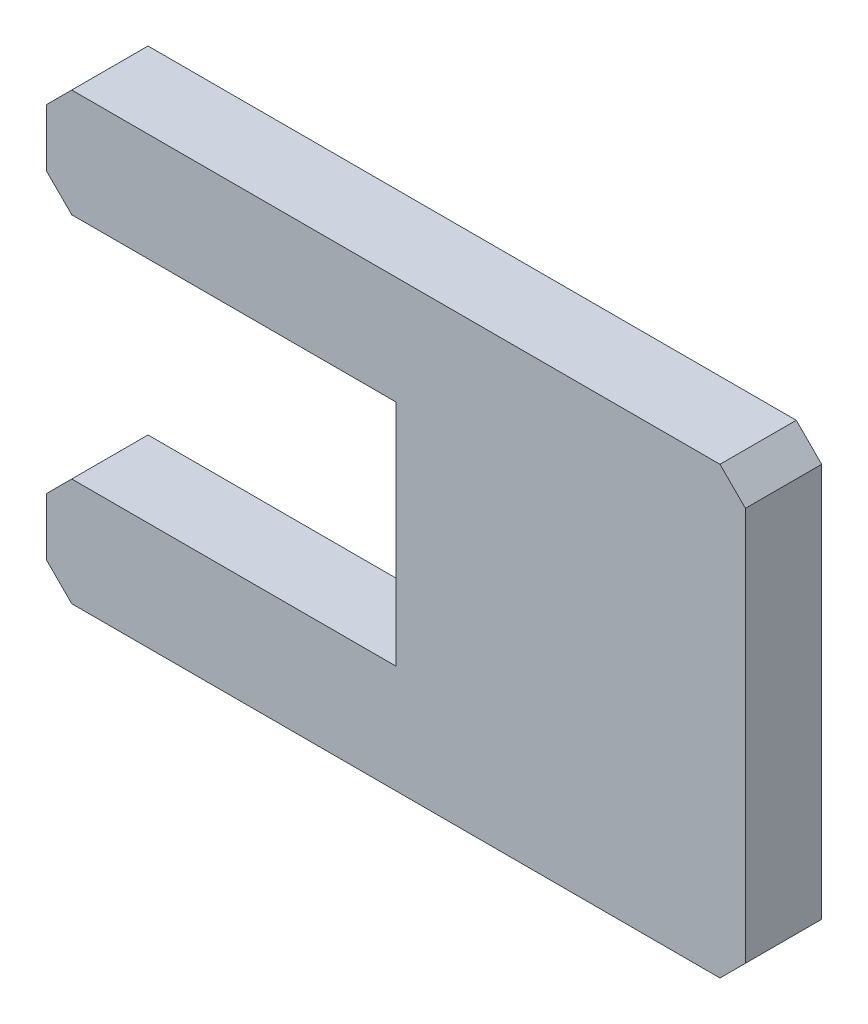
ISO-10303-21;
HEADER;
FILE_DESCRIPTION(('STEP AP214'),'2;1');
FILE_NAME('part.step','',(''),(''),'','','');
FILE_SCHEMA(('AUTOMOTIVE_DESIGN { 1 0 10303 214 1 1 1 1 }'));
ENDSEC;
DATA;
#1=APPLICATION_CONTEXT('core data for automotive mechanical design processes');
#2=APPLICATION_PROTOCOL_DEFINITION('international standard','automotive_design',2000,#1);
#3=PRODUCT_CONTEXT('',#1,'mechanical');
#4=PRODUCT('Part','Part','',(#3));
#5=PRODUCT_RELATED_PRODUCT_CATEGORY('part','',(#4));
#6=PRODUCT_DEFINITION_FORMATION('','',#4);
#7=PRODUCT_DEFINITION_CONTEXT('part definition',#1,'design');
#8=PRODUCT_DEFINITION('design','',#6,#7);
#9=PRODUCT_DEFINITION_SHAPE('','',#8);
#10=(LENGTH_UNIT() NAMED_UNIT(*) SI_UNIT(.MILLI.,.METRE.));
#11=(NAMED_UNIT(*) PLANE_ANGLE_UNIT() SI_UNIT($,.RADIAN.));
#12=(NAMED_UNIT(*) SI_UNIT($,.STERADIAN.) SOLID_ANGLE_UNIT());
#13=UNCERTAINTY_MEASURE_WITH_UNIT(LENGTH_MEASURE(1.E-05),#10,'distance_accuracy_value','');
#14=(GEOMETRIC_REPRESENTATION_CONTEXT(3) GLOBAL_UNCERTAINTY_ASSIGNED_CONTEXT((#13)) GLOBAL_UNIT_ASSIGNED_CONTEXT((#10,
#11,#12)) REPRESENTATION_CONTEXT('',''));
#15=CARTESIAN_POINT('',(0.,0.,0.));
#16=DIRECTION('',(0.,0.,1.));
#17=DIRECTION('',(1.,0.,0.));
#18=AXIS2_PLACEMENT_3D('',#15,#16,#17);
#19=CARTESIAN_POINT('',(27.5,17.5,6.));
#20=DIRECTION('',(-1.,0.,0.));
#21=DIRECTION('',(0.,0.,1.));
#22=AXIS2_PLACEMENT_3D('',#19,#20,#21);
#23=PLANE('',#22);
#24=DIRECTION('',(0.,1.,0.));
#25=VECTOR('',#24,1.);
#26=CARTESIAN_POINT('',(27.5,17.5,6.));
#27=LINE('',#26,#25);
#28=CARTESIAN_POINT('',(27.5,-15.5,6.));
#29=VERTEX_POINT('',#28);
#30=CARTESIAN_POINT('',(27.5,15.5,6.));
#31=VERTEX_POINT('',#30);
#32=EDGE_CURVE('E175',#29,#31,#27,.T.);
#33=ORIENTED_EDGE('',*,*,#32,.F.);
#34=DIRECTION('',(0.,0.,-1.));
#35=VECTOR('',#34,1.);
#36=CARTESIAN_POINT('',(27.5,-15.5,6.));
#37=LINE('',#36,#35);
#38=CARTESIAN_POINT('',(27.5,-15.5,0.));
#39=VERTEX_POINT('',#38);
#40=EDGE_CURVE('E178',#29,#39,#37,.T.);
#41=ORIENTED_EDGE('',*,*,#40,.T.);
#42=DIRECTION('',(0.,1.,0.));
#43=VECTOR('',#42,1.);
#44=CARTESIAN_POINT('',(27.5,17.5,0.));
#45=LINE('',#44,#43);
#46=CARTESIAN_POINT('',(27.5,15.5,0.));
#47=VERTEX_POINT('',#46);
#48=EDGE_CURVE('E155',#39,#47,#45,.T.);
#49=ORIENTED_EDGE('',*,*,#48,.T.);
#50=DIRECTION('',(0.,0.,1.));
#51=VECTOR('',#50,1.);
#52=CARTESIAN_POINT('',(27.5,15.5,6.));
#53=LINE('',#52,#51);
#54=EDGE_CURVE('E140',#47,#31,#53,.T.);
#55=ORIENTED_EDGE('',*,*,#54,.T.);
#56=EDGE_LOOP('',(#33,#41,#49,#55));
#57=FACE_BOUND('',#56,.T.);
#58=ADVANCED_FACE('F18',(#57),#23,.F.);
#59=CARTESIAN_POINT('',(-27.5,17.5,6.));
#60=DIRECTION('',(0.,-1.,0.));
#61=DIRECTION('',(0.,0.,-1.));
#62=AXIS2_PLACEMENT_3D('',#59,#60,#61);
#63=PLANE('',#62);
#64=DIRECTION('',(-1.,0.,0.));
#65=VECTOR('',#64,1.);
#66=CARTESIAN_POINT('',(-27.5,17.5,0.));
#67=LINE('',#66,#65);
#68=CARTESIAN_POINT('',(25.5,17.5,0.));
#69=VERTEX_POINT('',#68);
#70=CARTESIAN_POINT('',(-25.5,17.5,0.));
#71=VERTEX_POINT('',#70);
#72=EDGE_CURVE('E158',#69,#71,#67,.T.);
#73=ORIENTED_EDGE('',*,*,#72,.T.);
#74=DIRECTION('',(0.,0.,1.));
#75=VECTOR('',#74,1.);
#76=CARTESIAN_POINT('',(-25.5,17.5,6.));
#77=LINE('',#76,#75);
#78=CARTESIAN_POINT('',(-25.5,17.5,6.));
#79=VERTEX_POINT('',#78);
#80=EDGE_CURVE('E11',#71,#79,#77,.T.);
#81=ORIENTED_EDGE('',*,*,#80,.T.);
#82=DIRECTION('',(-1.,0.,0.));
#83=VECTOR('',#82,1.);
#84=CARTESIAN_POINT('',(-27.5,17.5,6.));
#85=LINE('',#84,#83);
#86=CARTESIAN_POINT('',(25.5,17.5,6.));
#87=VERTEX_POINT('',#86);
#88=EDGE_CURVE('E228',#87,#79,#85,.T.);
#89=ORIENTED_EDGE('',*,*,#88,.F.);
#90=DIRECTION('',(0.,0.,-1.));
#91=VECTOR('',#90,1.);
#92=CARTESIAN_POINT('',(25.5,17.5,6.));
#93=LINE('',#92,#91);
#94=EDGE_CURVE('E26',#87,#69,#93,.T.);
#95=ORIENTED_EDGE('',*,*,#94,.T.);
#96=EDGE_LOOP('',(#73,#81,#89,#95));
#97=FACE_BOUND('',#96,.T.);
#98=ADVANCED_FACE('F225',(#97),#63,.F.);
#99=CARTESIAN_POINT('',(-27.5,17.5,6.));
#100=DIRECTION('',(1.,0.,0.));
#101=DIRECTION('',(0.,1.,0.));
#102=AXIS2_PLACEMENT_3D('',#99,#100,#101);
#103=PLANE('',#102);
#104=DIRECTION('',(0.,-1.,0.));
#105=VECTOR('',#104,1.);
#106=CARTESIAN_POINT('',(-27.5,17.5,0.));
#107=LINE('',#106,#105);
#108=CARTESIAN_POINT('',(-27.5,15.5,0.));
#109=VERTEX_POINT('',#108);
#110=CARTESIAN_POINT('',(-27.5,11.,0.));
#111=VERTEX_POINT('',#110);
#112=EDGE_CURVE('E161',#109,#111,#107,.T.);
#113=ORIENTED_EDGE('',*,*,#112,.T.);
#114=DIRECTION('',(0.,0.,1.));
#115=VECTOR('',#114,1.);
#116=CARTESIAN_POINT('',(-27.5,11.,6.));
#117=LINE('',#116,#115);
#118=CARTESIAN_POINT('',(-27.5,11.,6.));
#119=VERTEX_POINT('',#118);
#120=EDGE_CURVE('E219',#111,#119,#117,.T.);
#121=ORIENTED_EDGE('',*,*,#120,.T.);
#122=DIRECTION('',(0.,-1.,0.));
#123=VECTOR('',#122,1.);
#124=CARTESIAN_POINT('',(-27.5,17.5,6.));
#125=LINE('',#124,#123);
#126=CARTESIAN_POINT('',(-27.5,15.5,6.));
#127=VERTEX_POINT('',#126);
#128=EDGE_CURVE('E131',#127,#119,#125,.T.);
#129=ORIENTED_EDGE('',*,*,#128,.F.);
#130=DIRECTION('',(0.,0.,-1.));
#131=VECTOR('',#130,1.);
#132=CARTESIAN_POINT('',(-27.5,15.5,6.));
#133=LINE('',#132,#131);
#134=EDGE_CURVE('E216',#127,#109,#133,.T.);
#135=ORIENTED_EDGE('',*,*,#134,.T.);
#136=EDGE_LOOP('',(#113,#121,#129,#135));
#137=FACE_BOUND('',#136,.T.);
#138=ADVANCED_FACE('F241',(#137),#103,.F.);
#139=CARTESIAN_POINT('',(0.,9.,6.));
#140=DIRECTION('',(0.,1.,0.));
#141=DIRECTION('',(-1.,0.,0.));
#142=AXIS2_PLACEMENT_3D('',#139,#140,#141);
#143=PLANE('',#142);
#144=DIRECTION('',(1.,0.,0.));
#145=VECTOR('',#144,1.);
#146=CARTESIAN_POINT('',(0.,9.,6.));
#147=LINE('',#146,#145);
#148=CARTESIAN_POINT('',(-25.5,9.,6.));
#149=VERTEX_POINT('',#148);
#150=CARTESIAN_POINT('',(0.,9.,6.));
#151=VERTEX_POINT('',#150);
#152=EDGE_CURVE('E118',#149,#151,#147,.T.);
#153=ORIENTED_EDGE('',*,*,#152,.F.);
#154=DIRECTION('',(0.,0.,-1.));
#155=VECTOR('',#154,1.);
#156=CARTESIAN_POINT('',(-25.5,9.,6.));
#157=LINE('',#156,#155);
#158=CARTESIAN_POINT('',(-25.5,9.,0.));
#159=VERTEX_POINT('',#158);
#160=EDGE_CURVE('E214',#149,#159,#157,.T.);
#161=ORIENTED_EDGE('',*,*,#160,.T.);
#162=DIRECTION('',(1.,0.,0.));
#163=VECTOR('',#162,1.);
#164=CARTESIAN_POINT('',(0.,9.,0.));
#165=LINE('',#164,#163);
#166=CARTESIAN_POINT('',(0.,9.,0.));
#167=VERTEX_POINT('',#166);
#168=EDGE_CURVE('E137',#159,#167,#165,.T.);
#169=ORIENTED_EDGE('',*,*,#168,.T.);
#170=DIRECTION('',(0.,0.,-1.));
#171=VECTOR('',#170,1.);
#172=CARTESIAN_POINT('',(0.,9.,6.));
#173=LINE('',#172,#171);
#174=EDGE_CURVE('E134',#151,#167,#173,.T.);
#175=ORIENTED_EDGE('',*,*,#174,.F.);
#176=EDGE_LOOP('',(#153,#161,#169,#175));
#177=FACE_BOUND('',#176,.T.);
#178=ADVANCED_FACE('F135',(#177),#143,.F.);
#179=CARTESIAN_POINT('',(0.,9.,6.));
#180=DIRECTION('',(1.,0.,0.));
#181=DIRECTION('',(0.,1.,0.));
#182=AXIS2_PLACEMENT_3D('',#179,#180,#181);
#183=PLANE('',#182);
#184=DIRECTION('',(0.,-1.,0.));
#185=VECTOR('',#184,1.);
#186=CARTESIAN_POINT('',(0.,9.,0.));
#187=LINE('',#186,#185);
#188=CARTESIAN_POINT('',(0.,-9.,0.));
#189=VERTEX_POINT('',#188);
#190=EDGE_CURVE('E165',#167,#189,#187,.T.);
#191=ORIENTED_EDGE('',*,*,#190,.T.);
#192=DIRECTION('',(0.,0.,-1.));
#193=VECTOR('',#192,1.);
#194=CARTESIAN_POINT('',(0.,-9.,6.));
#195=LINE('',#194,#193);
#196=CARTESIAN_POINT('',(0.,-9.,6.));
#197=VERTEX_POINT('',#196);
#198=EDGE_CURVE('E141',#197,#189,#195,.T.);
#199=ORIENTED_EDGE('',*,*,#198,.F.);
#200=DIRECTION('',(0.,-1.,0.));
#201=VECTOR('',#200,1.);
#202=CARTESIAN_POINT('',(0.,9.,6.));
#203=LINE('',#202,#201);
#204=EDGE_CURVE('E123',#151,#197,#203,.T.);
#205=ORIENTED_EDGE('',*,*,#204,.F.);
#206=ORIENTED_EDGE('',*,*,#174,.T.);
#207=EDGE_LOOP('',(#191,#199,#205,#206));
#208=FACE_BOUND('',#207,.T.);
#209=ADVANCED_FACE('F143',(#208),#183,.F.);
#210=CARTESIAN_POINT('',(0.,-9.,6.));
#211=DIRECTION('',(0.,-1.,0.));
#212=DIRECTION('',(1.,0.,0.));
#213=AXIS2_PLACEMENT_3D('',#210,#211,#212);
#214=PLANE('',#213);
#215=DIRECTION('',(-1.,0.,0.));
#216=VECTOR('',#215,1.);
#217=CARTESIAN_POINT('',(0.,-9.,0.));
#218=LINE('',#217,#216);
#219=CARTESIAN_POINT('',(-25.5,-9.,0.));
#220=VERTEX_POINT('',#219);
#221=EDGE_CURVE('E167',#189,#220,#218,.T.);
#222=ORIENTED_EDGE('',*,*,#221,.T.);
#223=DIRECTION('',(0.,0.,1.));
#224=VECTOR('',#223,1.);
#225=CARTESIAN_POINT('',(-25.5,-9.,6.));
#226=LINE('',#225,#224);
#227=CARTESIAN_POINT('',(-25.5,-9.,6.));
#228=VERTEX_POINT('',#227);
#229=EDGE_CURVE('E212',#220,#228,#226,.T.);
#230=ORIENTED_EDGE('',*,*,#229,.T.);
#231=DIRECTION('',(-1.,0.,0.));
#232=VECTOR('',#231,1.);
#233=CARTESIAN_POINT('',(0.,-9.,6.));
#234=LINE('',#233,#232);
#235=EDGE_CURVE('E146',#197,#228,#234,.T.);
#236=ORIENTED_EDGE('',*,*,#235,.F.);
#237=ORIENTED_EDGE('',*,*,#198,.T.);
#238=EDGE_LOOP('',(#222,#230,#236,#237));
#239=FACE_BOUND('',#238,.T.);
#240=ADVANCED_FACE('F286',(#239),#214,.F.);
#241=CARTESIAN_POINT('',(-27.5,-9.,6.));
#242=DIRECTION('',(1.,0.,0.));
#243=DIRECTION('',(0.,1.,0.));
#244=AXIS2_PLACEMENT_3D('',#241,#242,#243);
#245=PLANE('',#244);
#246=DIRECTION('',(0.,-1.,0.));
#247=VECTOR('',#246,1.);
#248=CARTESIAN_POINT('',(-27.5,-9.,0.));
#249=LINE('',#248,#247);
#250=CARTESIAN_POINT('',(-27.5,-11.,0.));
#251=VERTEX_POINT('',#250);
#252=CARTESIAN_POINT('',(-27.5,-15.5,0.));
#253=VERTEX_POINT('',#252);
#254=EDGE_CURVE('E170',#251,#253,#249,.T.);
#255=ORIENTED_EDGE('',*,*,#254,.T.);
#256=DIRECTION('',(0.,0.,1.));
#257=VECTOR('',#256,1.);
#258=CARTESIAN_POINT('',(-27.5,-15.5,6.));
#259=LINE('',#258,#257);
#260=CARTESIAN_POINT('',(-27.5,-15.5,6.));
#261=VERTEX_POINT('',#260);
#262=EDGE_CURVE('E33',#253,#261,#259,.T.);
#263=ORIENTED_EDGE('',*,*,#262,.T.);
#264=DIRECTION('',(0.,-1.,0.));
#265=VECTOR('',#264,1.);
#266=CARTESIAN_POINT('',(-27.5,-9.,6.));
#267=LINE('',#266,#265);
#268=CARTESIAN_POINT('',(-27.5,-11.,6.));
#269=VERTEX_POINT('',#268);
#270=EDGE_CURVE('E148',#269,#261,#267,.T.);
#271=ORIENTED_EDGE('',*,*,#270,.F.);
#272=DIRECTION('',(0.,0.,-1.));
#273=VECTOR('',#272,1.);
#274=CARTESIAN_POINT('',(-27.5,-11.,6.));
#275=LINE('',#274,#273);
#276=EDGE_CURVE('E208',#269,#251,#275,.T.);
#277=ORIENTED_EDGE('',*,*,#276,.T.);
#278=EDGE_LOOP('',(#255,#263,#271,#277));
#279=FACE_BOUND('',#278,.T.);
#280=ADVANCED_FACE('F289',(#279),#245,.F.);
#281=CARTESIAN_POINT('',(-27.5,-17.5,6.));
#282=DIRECTION('',(0.,1.,0.));
#283=DIRECTION('',(0.,0.,1.));
#284=AXIS2_PLACEMENT_3D('',#281,#282,#283);
#285=PLANE('',#284);
#286=DIRECTION('',(1.,0.,0.));
#287=VECTOR('',#286,1.);
#288=CARTESIAN_POINT('',(-27.5,-17.5,0.));
#289=LINE('',#288,#287);
#290=CARTESIAN_POINT('',(-25.5,-17.5,0.));
#291=VERTEX_POINT('',#290);
#292=CARTESIAN_POINT('',(25.5,-17.5,0.));
#293=VERTEX_POINT('',#292);
#294=EDGE_CURVE('E172',#291,#293,#289,.T.);
#295=ORIENTED_EDGE('',*,*,#294,.T.);
#296=DIRECTION('',(0.,0.,1.));
#297=VECTOR('',#296,1.);
#298=CARTESIAN_POINT('',(25.5,-17.5,6.));
#299=LINE('',#298,#297);
#300=CARTESIAN_POINT('',(25.5,-17.5,6.));
#301=VERTEX_POINT('',#300);
#302=EDGE_CURVE('E196',#293,#301,#299,.T.);
#303=ORIENTED_EDGE('',*,*,#302,.T.);
#304=DIRECTION('',(1.,0.,0.));
#305=VECTOR('',#304,1.);
#306=CARTESIAN_POINT('',(-27.5,-17.5,6.));
#307=LINE('',#306,#305);
#308=CARTESIAN_POINT('',(-25.5,-17.5,6.));
#309=VERTEX_POINT('',#308);
#310=EDGE_CURVE('E153',#309,#301,#307,.T.);
#311=ORIENTED_EDGE('',*,*,#310,.F.);
#312=DIRECTION('',(0.,0.,-1.));
#313=VECTOR('',#312,1.);
#314=CARTESIAN_POINT('',(-25.5,-17.5,6.));
#315=LINE('',#314,#313);
#316=EDGE_CURVE('E193',#309,#291,#315,.T.);
#317=ORIENTED_EDGE('',*,*,#316,.T.);
#318=EDGE_LOOP('',(#295,#303,#311,#317));
#319=FACE_BOUND('',#318,.T.);
#320=ADVANCED_FACE('F255',(#319),#285,.F.);
#321=CARTESIAN_POINT('',(0.,0.,6.));
#322=DIRECTION('',(0.,0.,1.));
#323=DIRECTION('',(1.,0.,0.));
#324=AXIS2_PLACEMENT_3D('',#321,#322,#323);
#325=PLANE('',#324);
#326=ORIENTED_EDGE('',*,*,#310,.T.);
#327=DIRECTION('',(-0.707106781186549,-0.707106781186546,0.));
#328=VECTOR('',#327,1.);
#329=CARTESIAN_POINT('',(21.5,-21.5,6.));
#330=LINE('',#329,#328);
#331=EDGE_CURVE('E206',#301,#29,#330,.F.);
#332=ORIENTED_EDGE('',*,*,#331,.T.);
#333=ORIENTED_EDGE('',*,*,#32,.T.);
#334=DIRECTION('',(0.707106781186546,-0.707106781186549,0.));
#335=VECTOR('',#334,1.);
#336=CARTESIAN_POINT('',(21.5,21.5,6.));
#337=LINE('',#336,#335);
#338=EDGE_CURVE('E198',#31,#87,#337,.F.);
#339=ORIENTED_EDGE('',*,*,#338,.T.);
#340=ORIENTED_EDGE('',*,*,#88,.T.);
#341=DIRECTION('',(0.707106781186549,0.707106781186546,0.));
#342=VECTOR('',#341,1.);
#343=CARTESIAN_POINT('',(-21.5,21.5,6.));
#344=LINE('',#343,#342);
#345=EDGE_CURVE('E200',#79,#127,#344,.F.);
#346=ORIENTED_EDGE('',*,*,#345,.T.);
#347=ORIENTED_EDGE('',*,*,#128,.T.);
#348=DIRECTION('',(-0.707106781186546,0.707106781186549,0.));
#349=VECTOR('',#348,1.);
#350=CARTESIAN_POINT('',(-8.25,-8.25,6.));
#351=LINE('',#350,#349);
#352=EDGE_CURVE('E127',#119,#149,#351,.F.);
#353=ORIENTED_EDGE('',*,*,#352,.T.);
#354=ORIENTED_EDGE('',*,*,#152,.T.);
#355=ORIENTED_EDGE('',*,*,#204,.T.);
#356=ORIENTED_EDGE('',*,*,#235,.T.);
#357=DIRECTION('',(0.707106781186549,0.707106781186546,0.));
#358=VECTOR('',#357,1.);
#359=CARTESIAN_POINT('',(-8.25,8.25,6.));
#360=LINE('',#359,#358);
#361=EDGE_CURVE('E40',#228,#269,#360,.F.);
#362=ORIENTED_EDGE('',*,*,#361,.T.);
#363=ORIENTED_EDGE('',*,*,#270,.T.);
#364=DIRECTION('',(-0.707106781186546,0.707106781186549,0.));
#365=VECTOR('',#364,1.);
#366=CARTESIAN_POINT('',(-21.5,-21.5,6.));
#367=LINE('',#366,#365);
#368=EDGE_CURVE('E204',#261,#309,#367,.F.);
#369=ORIENTED_EDGE('',*,*,#368,.T.);
#370=EDGE_LOOP('',(#326,#332,#333,#339,#340,#346,#347,#353,#354,#355,#356,#362,#363,#369));
#371=FACE_BOUND('',#370,.T.);
#372=ADVANCED_FACE('F121',(#371),#325,.T.);
#373=CARTESIAN_POINT('',(0.,0.,0.));
#374=DIRECTION('',(0.,0.,1.));
#375=DIRECTION('',(1.,0.,0.));
#376=AXIS2_PLACEMENT_3D('',#373,#374,#375);
#377=PLANE('',#376);
#378=ORIENTED_EDGE('',*,*,#48,.F.);
#379=DIRECTION('',(0.707106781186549,0.707106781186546,0.));
#380=VECTOR('',#379,1.);
#381=CARTESIAN_POINT('',(27.5,-15.5,0.));
#382=LINE('',#381,#380);
#383=EDGE_CURVE('E191',#39,#293,#382,.F.);
#384=ORIENTED_EDGE('',*,*,#383,.T.);
#385=ORIENTED_EDGE('',*,*,#294,.F.);
#386=DIRECTION('',(0.707106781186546,-0.707106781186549,0.));
#387=VECTOR('',#386,1.);
#388=CARTESIAN_POINT('',(-25.5,-17.5,0.));
#389=LINE('',#388,#387);
#390=EDGE_CURVE('E189',#291,#253,#389,.F.);
#391=ORIENTED_EDGE('',*,*,#390,.T.);
#392=ORIENTED_EDGE('',*,*,#254,.F.);
#393=DIRECTION('',(-0.707106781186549,-0.707106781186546,0.));
#394=VECTOR('',#393,1.);
#395=CARTESIAN_POINT('',(-27.5,-11.,0.));
#396=LINE('',#395,#394);
#397=EDGE_CURVE('E187',#251,#220,#396,.F.);
#398=ORIENTED_EDGE('',*,*,#397,.T.);
#399=ORIENTED_EDGE('',*,*,#221,.F.);
#400=ORIENTED_EDGE('',*,*,#190,.F.);
#401=ORIENTED_EDGE('',*,*,#168,.F.);
#402=DIRECTION('',(0.707106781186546,-0.707106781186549,0.));
#403=VECTOR('',#402,1.);
#404=CARTESIAN_POINT('',(-25.5,9.,0.));
#405=LINE('',#404,#403);
#406=EDGE_CURVE('E185',#159,#111,#405,.F.);
#407=ORIENTED_EDGE('',*,*,#406,.T.);
#408=ORIENTED_EDGE('',*,*,#112,.F.);
#409=DIRECTION('',(-0.707106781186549,-0.707106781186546,0.));
#410=VECTOR('',#409,1.);
#411=CARTESIAN_POINT('',(-27.5,15.5,0.));
#412=LINE('',#411,#410);
#413=EDGE_CURVE('E183',#109,#71,#412,.F.);
#414=ORIENTED_EDGE('',*,*,#413,.T.);
#415=ORIENTED_EDGE('',*,*,#72,.F.);
#416=DIRECTION('',(-0.707106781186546,0.707106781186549,0.));
#417=VECTOR('',#416,1.);
#418=CARTESIAN_POINT('',(25.5,17.5,0.));
#419=LINE('',#418,#417);
#420=EDGE_CURVE('E181',#69,#47,#419,.F.);
#421=ORIENTED_EDGE('',*,*,#420,.T.);
#422=EDGE_LOOP('',(#378,#384,#385,#391,#392,#398,#399,#400,#401,#407,#408,#414,#415,#421));
#423=FACE_BOUND('',#422,.T.);
#424=ADVANCED_FACE('F233',(#423),#377,.F.);
#425=CARTESIAN_POINT('',(27.5,-15.5,6.));
#426=DIRECTION('',(-0.707106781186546,0.707106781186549,0.));
#427=DIRECTION('',(0.,0.,-1.));
#428=AXIS2_PLACEMENT_3D('',#425,#426,#427);
#429=PLANE('',#428);
#430=ORIENTED_EDGE('',*,*,#331,.F.);
#431=ORIENTED_EDGE('',*,*,#302,.F.);
#432=ORIENTED_EDGE('',*,*,#383,.F.);
#433=ORIENTED_EDGE('',*,*,#40,.F.);
#434=EDGE_LOOP('',(#430,#431,#432,#433));
#435=FACE_BOUND('',#434,.T.);
#436=ADVANCED_FACE('F258',(#435),#429,.F.);
#437=CARTESIAN_POINT('',(-25.5,-17.5,6.));
#438=DIRECTION('',(0.707106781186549,0.707106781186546,0.));
#439=DIRECTION('',(0.,0.,-1.));
#440=AXIS2_PLACEMENT_3D('',#437,#438,#439);
#441=PLANE('',#440);
#442=ORIENTED_EDGE('',*,*,#368,.F.);
#443=ORIENTED_EDGE('',*,*,#262,.F.);
#444=ORIENTED_EDGE('',*,*,#390,.F.);
#445=ORIENTED_EDGE('',*,*,#316,.F.);
#446=EDGE_LOOP('',(#442,#443,#444,#445));
#447=FACE_BOUND('',#446,.T.);
#448=ADVANCED_FACE('F260',(#447),#441,.F.);
#449=CARTESIAN_POINT('',(-27.5,-11.,6.));
#450=DIRECTION('',(0.707106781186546,-0.707106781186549,0.));
#451=DIRECTION('',(0.,0.,-1.));
#452=AXIS2_PLACEMENT_3D('',#449,#450,#451);
#453=PLANE('',#452);
#454=ORIENTED_EDGE('',*,*,#361,.F.);
#455=ORIENTED_EDGE('',*,*,#229,.F.);
#456=ORIENTED_EDGE('',*,*,#397,.F.);
#457=ORIENTED_EDGE('',*,*,#276,.F.);
#458=EDGE_LOOP('',(#454,#455,#456,#457));
#459=FACE_BOUND('',#458,.T.);
#460=ADVANCED_FACE('F268',(#459),#453,.F.);
#461=CARTESIAN_POINT('',(-25.5,9.,6.));
#462=DIRECTION('',(0.707106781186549,0.707106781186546,0.));
#463=DIRECTION('',(0.,0.,-1.));
#464=AXIS2_PLACEMENT_3D('',#461,#462,#463);
#465=PLANE('',#464);
#466=ORIENTED_EDGE('',*,*,#352,.F.);
#467=ORIENTED_EDGE('',*,*,#120,.F.);
#468=ORIENTED_EDGE('',*,*,#406,.F.);
#469=ORIENTED_EDGE('',*,*,#160,.F.);
#470=EDGE_LOOP('',(#466,#467,#468,#469));
#471=FACE_BOUND('',#470,.T.);
#472=ADVANCED_FACE('F338',(#471),#465,.F.);
#473=CARTESIAN_POINT('',(-27.5,15.5,6.));
#474=DIRECTION('',(0.707106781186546,-0.707106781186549,0.));
#475=DIRECTION('',(0.,0.,-1.));
#476=AXIS2_PLACEMENT_3D('',#473,#474,#475);
#477=PLANE('',#476);
#478=ORIENTED_EDGE('',*,*,#345,.F.);
#479=ORIENTED_EDGE('',*,*,#80,.F.);
#480=ORIENTED_EDGE('',*,*,#413,.F.);
#481=ORIENTED_EDGE('',*,*,#134,.F.);
#482=EDGE_LOOP('',(#478,#479,#480,#481));
#483=FACE_BOUND('',#482,.T.);
#484=ADVANCED_FACE('F238',(#483),#477,.F.);
#485=CARTESIAN_POINT('',(25.5,17.5,6.));
#486=DIRECTION('',(-0.707106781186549,-0.707106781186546,0.));
#487=DIRECTION('',(0.,0.,-1.));
#488=AXIS2_PLACEMENT_3D('',#485,#486,#487);
#489=PLANE('',#488);
#490=ORIENTED_EDGE('',*,*,#338,.F.);
#491=ORIENTED_EDGE('',*,*,#54,.F.);
#492=ORIENTED_EDGE('',*,*,#420,.F.);
#493=ORIENTED_EDGE('',*,*,#94,.F.);
#494=EDGE_LOOP('',(#490,#491,#492,#493));
#495=FACE_BOUND('',#494,.T.);
#496=ADVANCED_FACE('F20',(#495),#489,.F.);
#497=CLOSED_SHELL('',(#58,#98,#138,#178,#209,#240,#280,#320,#372,#424,#436,#448,#460,#472,#484,#496));
#498=MANIFOLD_SOLID_BREP('B1',#497);
#499=ADVANCED_BREP_SHAPE_REPRESENTATION('',(#18,#498),#14);
#500=SHAPE_DEFINITION_REPRESENTATION(#9,#499);
ENDSEC;
END-ISO-10303-21;
